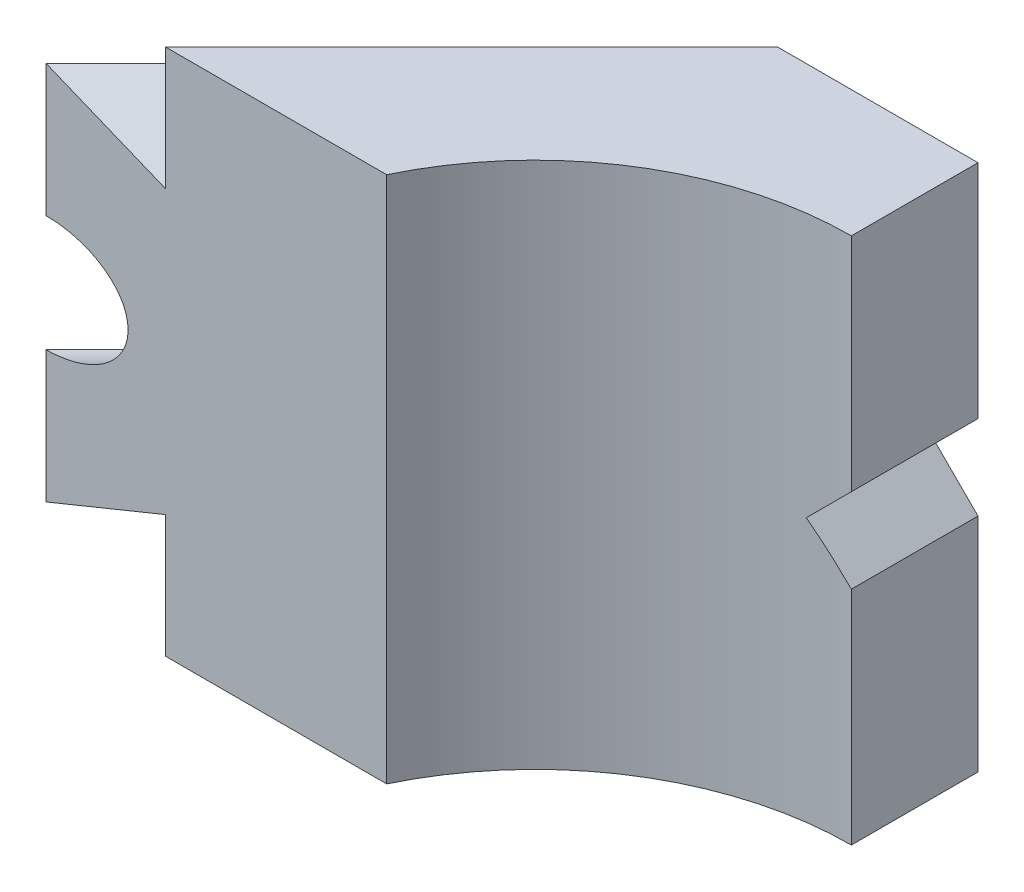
ISO-10303-21;
HEADER;
FILE_DESCRIPTION(('STEP AP214'),'2;1');
FILE_NAME('part.step','',(''),(''),'','','');
FILE_SCHEMA(('AUTOMOTIVE_DESIGN { 1 0 10303 214 1 1 1 1 }'));
ENDSEC;
DATA;
#1=APPLICATION_CONTEXT('core data for automotive mechanical design processes');
#2=APPLICATION_PROTOCOL_DEFINITION('international standard','automotive_design',2000,#1);
#3=PRODUCT_CONTEXT('',#1,'mechanical');
#4=PRODUCT('Part','Part','',(#3));
#5=PRODUCT_RELATED_PRODUCT_CATEGORY('part','',(#4));
#6=PRODUCT_DEFINITION_FORMATION('','',#4);
#7=PRODUCT_DEFINITION_CONTEXT('part definition',#1,'design');
#8=PRODUCT_DEFINITION('design','',#6,#7);
#9=PRODUCT_DEFINITION_SHAPE('','',#8);
#10=(LENGTH_UNIT() NAMED_UNIT(*) SI_UNIT(.MILLI.,.METRE.));
#11=(NAMED_UNIT(*) PLANE_ANGLE_UNIT() SI_UNIT($,.RADIAN.));
#12=(NAMED_UNIT(*) SI_UNIT($,.STERADIAN.) SOLID_ANGLE_UNIT());
#13=UNCERTAINTY_MEASURE_WITH_UNIT(LENGTH_MEASURE(1.E-05),#10,'distance_accuracy_value','');
#14=(GEOMETRIC_REPRESENTATION_CONTEXT(3) GLOBAL_UNCERTAINTY_ASSIGNED_CONTEXT((#13)) GLOBAL_UNIT_ASSIGNED_CONTEXT((#10,
#11,#12)) REPRESENTATION_CONTEXT('',''));
#15=CARTESIAN_POINT('',(0.,0.,0.));
#16=DIRECTION('',(0.,0.,1.));
#17=DIRECTION('',(1.,0.,0.));
#18=AXIS2_PLACEMENT_3D('',#15,#16,#17);
#19=CARTESIAN_POINT('',(-7.29162231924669,2.33001662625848,6.85913527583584));
#20=DIRECTION('',(0.707106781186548,0.,-0.707106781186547));
#21=DIRECTION('',(0.270856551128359,0.923728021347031,0.270856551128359));
#22=AXIS2_PLACEMENT_3D('',#19,#20,#21);
#23=PLANE('',#22);
#24=DIRECTION('',(-0.561155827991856,-0.6084474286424,-0.561155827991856));
#25=VECTOR('',#24,1.);
#26=CARTESIAN_POINT('',(-7.29162231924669,2.33001662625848,6.85913527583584));
#27=LINE('',#26,#25);
#28=CARTESIAN_POINT('',(-7.29162231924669,2.33001662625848,6.85913527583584));
#29=VERTEX_POINT('',#28);
#30=CARTESIAN_POINT('',(-8.61033851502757,0.900165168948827,5.54041908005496));
#31=VERTEX_POINT('',#30);
#32=EDGE_CURVE('E235',#29,#31,#27,.T.);
#33=ORIENTED_EDGE('',*,*,#32,.T.);
#34=DIRECTION('',(0.0920185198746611,-0.991496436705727,0.0920185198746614));
#35=VECTOR('',#34,1.);
#36=CARTESIAN_POINT('',(-8.61033851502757,0.900165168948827,5.54041908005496));
#37=LINE('',#36,#35);
#38=CARTESIAN_POINT('',(-8.39409499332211,-1.42985145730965,5.75666260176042));
#39=VERTEX_POINT('',#38);
#40=EDGE_CURVE('E238',#31,#39,#37,.T.);
#41=ORIENTED_EDGE('',*,*,#40,.T.);
#42=DIRECTION('',(0.653174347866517,-0.383049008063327,0.653174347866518));
#43=VECTOR('',#42,1.);
#44=CARTESIAN_POINT('',(-8.39409499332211,-1.42985145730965,5.75666260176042));
#45=LINE('',#44,#43);
#46=CARTESIAN_POINT('',(-6.85913527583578,-2.33001662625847,7.29162231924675));
#47=VERTEX_POINT('',#46);
#48=EDGE_CURVE('E241',#39,#47,#45,.T.);
#49=ORIENTED_EDGE('',*,*,#48,.T.);
#50=DIRECTION('',(0.561155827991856,0.6084474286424,0.561155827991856));
#51=VECTOR('',#50,1.);
#52=CARTESIAN_POINT('',(-6.85913527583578,-2.33001662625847,7.29162231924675));
#53=LINE('',#52,#51);
#54=CARTESIAN_POINT('',(-5.54041908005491,-0.900165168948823,8.61033851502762));
#55=VERTEX_POINT('',#54);
#56=EDGE_CURVE('E244',#47,#55,#53,.T.);
#57=ORIENTED_EDGE('',*,*,#56,.T.);
#58=DIRECTION('',(-0.092018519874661,0.991496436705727,-0.0920185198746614));
#59=VECTOR('',#58,1.);
#60=CARTESIAN_POINT('',(-5.54041908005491,-0.900165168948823,8.61033851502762));
#61=LINE('',#60,#59);
#62=CARTESIAN_POINT('',(-5.75666260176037,1.42985145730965,8.39409499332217));
#63=VERTEX_POINT('',#62);
#64=EDGE_CURVE('E247',#55,#63,#61,.T.);
#65=ORIENTED_EDGE('',*,*,#64,.T.);
#66=DIRECTION('',(-0.653174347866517,0.383049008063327,-0.653174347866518));
#67=VECTOR('',#66,1.);
#68=CARTESIAN_POINT('',(-5.75666260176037,1.42985145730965,8.39409499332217));
#69=LINE('',#68,#67);
#70=EDGE_CURVE('E250',#63,#29,#69,.T.);
#71=ORIENTED_EDGE('',*,*,#70,.T.);
#72=EDGE_LOOP('',(#33,#41,#49,#57,#65,#71));
#73=FACE_BOUND('',#72,.T.);
#74=ADVANCED_FACE('F14',(#73),#23,.F.);
#75=CARTESIAN_POINT('',(-8.61033851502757,0.900165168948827,5.54041908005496));
#76=DIRECTION('',(-0.701093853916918,-0.130133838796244,-0.701093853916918));
#77=DIRECTION('',(0.0920185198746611,-0.991496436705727,0.0920185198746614));
#78=AXIS2_PLACEMENT_3D('',#75,#76,#77);
#79=PLANE('',#78);
#80=DIRECTION('',(0.0920185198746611,-0.991496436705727,0.0920185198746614));
#81=VECTOR('',#80,1.);
#82=CARTESIAN_POINT('',(-11.4387656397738,0.900165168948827,8.36884620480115));
#83=LINE('',#82,#81);
#84=CARTESIAN_POINT('',(-11.4387656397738,0.900165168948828,8.36884620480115));
#85=VERTEX_POINT('',#84);
#86=CARTESIAN_POINT('',(-11.2225221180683,-1.42985145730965,8.58508972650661));
#87=VERTEX_POINT('',#86);
#88=EDGE_CURVE('E220',#85,#87,#83,.T.);
#89=ORIENTED_EDGE('',*,*,#88,.T.);
#90=DIRECTION('',(-0.707106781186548,0.,0.707106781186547));
#91=VECTOR('',#90,1.);
#92=CARTESIAN_POINT('',(-8.39409499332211,-1.42985145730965,5.75666260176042));
#93=LINE('',#92,#91);
#94=EDGE_CURVE('E263',#39,#87,#93,.T.);
#95=ORIENTED_EDGE('',*,*,#94,.F.);
#96=ORIENTED_EDGE('',*,*,#40,.F.);
#97=DIRECTION('',(-0.707106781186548,0.,0.707106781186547));
#98=VECTOR('',#97,1.);
#99=CARTESIAN_POINT('',(-8.61033851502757,0.900165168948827,5.54041908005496));
#100=LINE('',#99,#98);
#101=EDGE_CURVE('E253',#31,#85,#100,.T.);
#102=ORIENTED_EDGE('',*,*,#101,.T.);
#103=EDGE_LOOP('',(#89,#95,#96,#102));
#104=FACE_BOUND('',#103,.T.);
#105=ADVANCED_FACE('F289',(#104),#79,.F.);
#106=CARTESIAN_POINT('',(-8.39409499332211,-1.42985145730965,5.75666260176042));
#107=DIRECTION('',(-0.270856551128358,-0.923728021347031,-0.270856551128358));
#108=DIRECTION('',(0.653174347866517,-0.383049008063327,0.653174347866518));
#109=AXIS2_PLACEMENT_3D('',#106,#107,#108);
#110=PLANE('',#109);
#111=DIRECTION('',(0.653174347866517,-0.383049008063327,0.653174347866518));
#112=VECTOR('',#111,1.);
#113=CARTESIAN_POINT('',(-11.2225221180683,-1.42985145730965,8.58508972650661));
#114=LINE('',#113,#112);
#115=CARTESIAN_POINT('',(-9.68756240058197,-2.33001662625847,10.1200494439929));
#116=VERTEX_POINT('',#115);
#117=EDGE_CURVE('E223',#87,#116,#114,.T.);
#118=ORIENTED_EDGE('',*,*,#117,.T.);
#119=DIRECTION('',(-0.707106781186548,0.,0.707106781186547));
#120=VECTOR('',#119,1.);
#121=CARTESIAN_POINT('',(-6.85913527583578,-2.33001662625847,7.29162231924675));
#122=LINE('',#121,#120);
#123=EDGE_CURVE('E261',#47,#116,#122,.T.);
#124=ORIENTED_EDGE('',*,*,#123,.F.);
#125=ORIENTED_EDGE('',*,*,#48,.F.);
#126=ORIENTED_EDGE('',*,*,#94,.T.);
#127=EDGE_LOOP('',(#118,#124,#125,#126));
#128=FACE_BOUND('',#127,.T.);
#129=ADVANCED_FACE('F296',(#128),#110,.F.);
#130=CARTESIAN_POINT('',(-6.85913527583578,-2.33001662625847,7.29162231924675));
#131=DIRECTION('',(0.430237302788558,-0.793594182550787,0.430237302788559));
#132=DIRECTION('',(0.561155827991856,0.6084474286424,0.561155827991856));
#133=AXIS2_PLACEMENT_3D('',#130,#131,#132);
#134=PLANE('',#133);
#135=DIRECTION('',(0.561155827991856,0.6084474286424,0.561155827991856));
#136=VECTOR('',#135,1.);
#137=CARTESIAN_POINT('',(-9.68756240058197,-2.33001662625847,10.1200494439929));
#138=LINE('',#137,#136);
#139=CARTESIAN_POINT('',(-8.3688462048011,-0.900165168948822,11.4387656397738));
#140=VERTEX_POINT('',#139);
#141=EDGE_CURVE('E226',#116,#140,#138,.T.);
#142=ORIENTED_EDGE('',*,*,#141,.T.);
#143=DIRECTION('',(-0.707106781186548,0.,0.707106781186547));
#144=VECTOR('',#143,1.);
#145=CARTESIAN_POINT('',(-5.54041908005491,-0.900165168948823,8.61033851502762));
#146=LINE('',#145,#144);
#147=EDGE_CURVE('E259',#55,#140,#146,.T.);
#148=ORIENTED_EDGE('',*,*,#147,.F.);
#149=ORIENTED_EDGE('',*,*,#56,.F.);
#150=ORIENTED_EDGE('',*,*,#123,.T.);
#151=EDGE_LOOP('',(#142,#148,#149,#150));
#152=FACE_BOUND('',#151,.T.);
#153=ADVANCED_FACE('F308',(#152),#134,.F.);
#154=CARTESIAN_POINT('',(-5.54041908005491,-0.900165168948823,8.61033851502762));
#155=DIRECTION('',(0.701093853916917,0.130133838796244,0.701093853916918));
#156=DIRECTION('',(-0.092018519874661,0.991496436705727,-0.0920185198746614));
#157=AXIS2_PLACEMENT_3D('',#154,#155,#156);
#158=PLANE('',#157);
#159=DIRECTION('',(-0.092018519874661,0.991496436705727,-0.0920185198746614));
#160=VECTOR('',#159,1.);
#161=CARTESIAN_POINT('',(-8.3688462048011,-0.900165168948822,11.4387656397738));
#162=LINE('',#161,#160);
#163=CARTESIAN_POINT('',(-8.58508972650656,1.42985145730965,11.2225221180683));
#164=VERTEX_POINT('',#163);
#165=EDGE_CURVE('E229',#140,#164,#162,.T.);
#166=ORIENTED_EDGE('',*,*,#165,.T.);
#167=DIRECTION('',(-0.707106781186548,0.,0.707106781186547));
#168=VECTOR('',#167,1.);
#169=CARTESIAN_POINT('',(-5.75666260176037,1.42985145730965,8.39409499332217));
#170=LINE('',#169,#168);
#171=EDGE_CURVE('E257',#63,#164,#170,.T.);
#172=ORIENTED_EDGE('',*,*,#171,.F.);
#173=ORIENTED_EDGE('',*,*,#64,.F.);
#174=ORIENTED_EDGE('',*,*,#147,.T.);
#175=EDGE_LOOP('',(#166,#172,#173,#174));
#176=FACE_BOUND('',#175,.T.);
#177=ADVANCED_FACE('F304',(#176),#158,.F.);
#178=CARTESIAN_POINT('',(-5.75666260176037,1.42985145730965,8.39409499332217));
#179=DIRECTION('',(0.270856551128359,0.923728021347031,0.270856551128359));
#180=DIRECTION('',(-0.707106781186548,0.,0.707106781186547));
#181=AXIS2_PLACEMENT_3D('',#178,#179,#180);
#182=PLANE('',#181);
#183=DIRECTION('',(-0.653174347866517,0.383049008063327,-0.653174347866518));
#184=VECTOR('',#183,1.);
#185=CARTESIAN_POINT('',(-8.58508972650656,1.42985145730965,11.2225221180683));
#186=LINE('',#185,#184);
#187=CARTESIAN_POINT('',(-10.1200494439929,2.33001662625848,9.68756240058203));
#188=VERTEX_POINT('',#187);
#189=EDGE_CURVE('E232',#164,#188,#186,.T.);
#190=ORIENTED_EDGE('',*,*,#189,.T.);
#191=DIRECTION('',(-0.707106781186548,0.,0.707106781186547));
#192=VECTOR('',#191,1.);
#193=CARTESIAN_POINT('',(-7.29162231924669,2.33001662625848,6.85913527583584));
#194=LINE('',#193,#192);
#195=EDGE_CURVE('E254',#29,#188,#194,.T.);
#196=ORIENTED_EDGE('',*,*,#195,.F.);
#197=ORIENTED_EDGE('',*,*,#70,.F.);
#198=ORIENTED_EDGE('',*,*,#171,.T.);
#199=EDGE_LOOP('',(#190,#196,#197,#198));
#200=FACE_BOUND('',#199,.T.);
#201=ADVANCED_FACE('F285',(#200),#182,.F.);
#202=CARTESIAN_POINT('',(-7.29162231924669,2.33001662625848,6.85913527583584));
#203=DIRECTION('',(-0.430237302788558,0.793594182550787,-0.430237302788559));
#204=DIRECTION('',(-0.561155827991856,-0.6084474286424,-0.561155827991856));
#205=AXIS2_PLACEMENT_3D('',#202,#203,#204);
#206=PLANE('',#205);
#207=DIRECTION('',(-0.561155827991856,-0.6084474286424,-0.561155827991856));
#208=VECTOR('',#207,1.);
#209=CARTESIAN_POINT('',(-10.1200494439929,2.33001662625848,9.68756240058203));
#210=LINE('',#209,#208);
#211=EDGE_CURVE('E218',#188,#85,#210,.T.);
#212=ORIENTED_EDGE('',*,*,#211,.T.);
#213=ORIENTED_EDGE('',*,*,#101,.F.);
#214=ORIENTED_EDGE('',*,*,#32,.F.);
#215=ORIENTED_EDGE('',*,*,#195,.T.);
#216=EDGE_LOOP('',(#212,#213,#214,#215));
#217=FACE_BOUND('',#216,.T.);
#218=ADVANCED_FACE('F277',(#217),#206,.F.);
#219=CARTESIAN_POINT('',(-2.83273811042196,0.,2.83273811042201));
#220=DIRECTION('',(-0.707106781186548,0.,0.707106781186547));
#221=DIRECTION('',(-0.270856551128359,-0.923728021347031,-0.270856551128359));
#222=AXIS2_PLACEMENT_3D('',#219,#220,#221);
#223=PLANE('',#222);
#224=CARTESIAN_POINT('',(-2.83273811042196,0.,2.83273811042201));
#225=DIRECTION('',(-0.707106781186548,0.,0.707106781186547));
#226=DIRECTION('',(-0.270856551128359,-0.923728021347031,-0.270856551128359));
#227=AXIS2_PLACEMENT_3D('',#224,#225,#226);
#228=CIRCLE('',#227,5.);
#229=CARTESIAN_POINT('',(-2.83273811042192,5.,2.83273811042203));
#230=VERTEX_POINT('',#229);
#231=CARTESIAN_POINT('',(-2.83273811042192,-5.,2.83273811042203));
#232=VERTEX_POINT('',#231);
#233=EDGE_CURVE('E256',#230,#232,#228,.T.);
#234=ORIENTED_EDGE('',*,*,#233,.F.);
#235=DIRECTION('',(0.,-1.,0.));
#236=VECTOR('',#235,1.);
#237=CARTESIAN_POINT('',(-2.83273811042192,-12.5,2.83273811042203));
#238=LINE('',#237,#236);
#239=EDGE_CURVE('E205',#230,#232,#238,.T.);
#240=ORIENTED_EDGE('',*,*,#239,.T.);
#241=EDGE_LOOP('',(#234,#240));
#242=FACE_BOUND('',#241,.T.);
#243=ADVANCED_FACE('F275',(#242),#223,.F.);
#244=CARTESIAN_POINT('',(-9.90380592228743,0.,9.90380592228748));
#245=DIRECTION('',(-0.707106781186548,0.,0.707106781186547));
#246=DIRECTION('',(-0.270856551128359,-0.923728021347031,-0.270856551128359));
#247=AXIS2_PLACEMENT_3D('',#244,#245,#246);
#248=PLANE('',#247);
#249=DIRECTION('',(0.,-1.,0.));
#250=VECTOR('',#249,1.);
#251=CARTESIAN_POINT('',(-9.90380592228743,-12.5,9.90380592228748));
#252=LINE('',#251,#250);
#253=CARTESIAN_POINT('',(-9.90380592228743,-2.75,9.90380592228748));
#254=VERTEX_POINT('',#253);
#255=CARTESIAN_POINT('',(-9.90380592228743,-5.,9.90380592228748));
#256=VERTEX_POINT('',#255);
#257=EDGE_CURVE('E31',#254,#256,#252,.T.);
#258=ORIENTED_EDGE('',*,*,#257,.F.);
#259=CARTESIAN_POINT('',(-9.90380592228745,0.,9.90380592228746));
#260=DIRECTION('',(-0.707106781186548,0.,0.707106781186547));
#261=DIRECTION('',(0.707106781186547,0.,0.707106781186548));
#262=AXIS2_PLACEMENT_3D('',#259,#260,#261);
#263=CIRCLE('',#262,2.75);
#264=CARTESIAN_POINT('',(-9.90380592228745,2.75,9.90380592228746));
#265=VERTEX_POINT('',#264);
#266=EDGE_CURVE('E530',#254,#265,#263,.T.);
#267=ORIENTED_EDGE('',*,*,#266,.T.);
#268=CARTESIAN_POINT('',(-9.90380592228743,5.,9.90380592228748));
#269=VERTEX_POINT('',#268);
#270=EDGE_CURVE('E39',#269,#265,#252,.T.);
#271=ORIENTED_EDGE('',*,*,#270,.F.);
#272=CARTESIAN_POINT('',(-9.90380592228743,0.,9.90380592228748));
#273=DIRECTION('',(-0.707106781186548,0.,0.707106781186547));
#274=DIRECTION('',(-0.270856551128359,-0.923728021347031,-0.270856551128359));
#275=AXIS2_PLACEMENT_3D('',#272,#273,#274);
#276=CIRCLE('',#275,5.);
#277=EDGE_CURVE('E18',#269,#256,#276,.T.);
#278=ORIENTED_EDGE('',*,*,#277,.T.);
#279=EDGE_LOOP('',(#258,#267,#271,#278));
#280=FACE_BOUND('',#279,.T.);
#281=ORIENTED_EDGE('',*,*,#211,.F.);
#282=ORIENTED_EDGE('',*,*,#189,.F.);
#283=ORIENTED_EDGE('',*,*,#165,.F.);
#284=ORIENTED_EDGE('',*,*,#141,.F.);
#285=ORIENTED_EDGE('',*,*,#117,.F.);
#286=ORIENTED_EDGE('',*,*,#88,.F.);
#287=EDGE_LOOP('',(#281,#282,#283,#284,#285,#286));
#288=FACE_BOUND('',#287,.T.);
#289=ADVANCED_FACE('F271',(#280,#288),#248,.T.);
#290=CARTESIAN_POINT('',(-9.90380592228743,0.,9.90380592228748));
#291=DIRECTION('',(0.707106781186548,0.,-0.707106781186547));
#292=DIRECTION('',(0.270856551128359,0.923728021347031,0.270856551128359));
#293=AXIS2_PLACEMENT_3D('',#290,#291,#292);
#294=CYLINDRICAL_SURFACE('',#293,5.);
#295=DIRECTION('',(-0.707106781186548,0.,0.707106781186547));
#296=VECTOR('',#295,1.);
#297=CARTESIAN_POINT('',(-2.83273811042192,-5.,2.83273811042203));
#298=LINE('',#297,#296);
#299=EDGE_CURVE('E9',#256,#232,#298,.F.);
#300=ORIENTED_EDGE('',*,*,#299,.F.);
#301=ORIENTED_EDGE('',*,*,#277,.F.);
#302=DIRECTION('',(-0.707106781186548,0.,0.707106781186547));
#303=VECTOR('',#302,1.);
#304=CARTESIAN_POINT('',(-2.83273811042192,5.,2.83273811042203));
#305=LINE('',#304,#303);
#306=EDGE_CURVE('E23',#230,#269,#305,.T.);
#307=ORIENTED_EDGE('',*,*,#306,.F.);
#308=ORIENTED_EDGE('',*,*,#233,.T.);
#309=EDGE_LOOP('',(#300,#301,#307,#308));
#310=FACE_BOUND('',#309,.T.);
#311=ADVANCED_FACE('F16',(#310),#294,.T.);
#312=CARTESIAN_POINT('',(15.16,12.5,21.));
#313=DIRECTION('',(0.,-1.,0.));
#314=DIRECTION('',(1.,0.,0.));
#315=AXIS2_PLACEMENT_3D('',#312,#313,#314);
#316=CYLINDRICAL_SURFACE('',#315,15.);
#317=CARTESIAN_POINT('',(15.16,2.,21.));
#318=DIRECTION('',(0.707106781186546,-0.707106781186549,0.));
#319=DIRECTION('',(-0.707106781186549,-0.707106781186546,0.));
#320=AXIS2_PLACEMENT_3D('',#317,#318,#319);
#321=ELLIPSE('',#320,21.2132034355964,15.);
#322=CARTESIAN_POINT('',(15.16,2.,6.));
#323=VERTEX_POINT('',#322);
#324=CARTESIAN_POINT('',(13.16,0.,6.13393125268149));
#325=VERTEX_POINT('',#324);
#326=EDGE_CURVE('E552',#323,#325,#321,.F.);
#327=ORIENTED_EDGE('',*,*,#326,.F.);
#328=DIRECTION('',(0.,-1.,0.));
#329=VECTOR('',#328,1.);
#330=CARTESIAN_POINT('',(15.16,12.5,6.));
#331=LINE('',#330,#329);
#332=CARTESIAN_POINT('',(15.16,12.5,6.));
#333=VERTEX_POINT('',#332);
#334=EDGE_CURVE('E196',#333,#323,#331,.T.);
#335=ORIENTED_EDGE('',*,*,#334,.F.);
#336=CARTESIAN_POINT('',(15.16,12.5,21.));
#337=DIRECTION('',(0.,-1.,0.));
#338=DIRECTION('',(-1.,0.,0.));
#339=AXIS2_PLACEMENT_3D('',#336,#337,#338);
#340=CIRCLE('',#339,15.);
#341=CARTESIAN_POINT('',(1.64149416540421,12.5,14.5));
#342=VERTEX_POINT('',#341);
#343=EDGE_CURVE('E568',#342,#333,#340,.T.);
#344=ORIENTED_EDGE('',*,*,#343,.F.);
#345=DIRECTION('',(0.,-1.,0.));
#346=VECTOR('',#345,1.);
#347=CARTESIAN_POINT('',(1.64149416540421,12.5,14.5));
#348=LINE('',#347,#346);
#349=CARTESIAN_POINT('',(1.64149416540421,-12.5,14.5));
#350=VERTEX_POINT('',#349);
#351=EDGE_CURVE('E192',#342,#350,#348,.T.);
#352=ORIENTED_EDGE('',*,*,#351,.T.);
#353=CARTESIAN_POINT('',(15.16,-12.5,21.));
#354=DIRECTION('',(0.,-1.,0.));
#355=DIRECTION('',(-1.,0.,0.));
#356=AXIS2_PLACEMENT_3D('',#353,#354,#355);
#357=CIRCLE('',#356,15.);
#358=CARTESIAN_POINT('',(15.16,-12.5,6.));
#359=VERTEX_POINT('',#358);
#360=EDGE_CURVE('E557',#350,#359,#357,.T.);
#361=ORIENTED_EDGE('',*,*,#360,.T.);
#362=CARTESIAN_POINT('',(15.16,-2.,6.));
#363=VERTEX_POINT('',#362);
#364=EDGE_CURVE('E578',#363,#359,#331,.T.);
#365=ORIENTED_EDGE('',*,*,#364,.F.);
#366=CARTESIAN_POINT('',(15.16,-2.,21.));
#367=DIRECTION('',(0.707106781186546,0.707106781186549,0.));
#368=DIRECTION('',(0.707106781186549,-0.707106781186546,0.));
#369=AXIS2_PLACEMENT_3D('',#366,#367,#368);
#370=ELLIPSE('',#369,21.2132034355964,15.);
#371=EDGE_CURVE('E550',#325,#363,#370,.F.);
#372=ORIENTED_EDGE('',*,*,#371,.F.);
#373=EDGE_LOOP('',(#327,#335,#344,#352,#361,#365,#372));
#374=FACE_BOUND('',#373,.T.);
#375=ADVANCED_FACE('F388',(#374),#316,.F.);
#376=CARTESIAN_POINT('',(15.16,-12.5,21.));
#377=DIRECTION('',(0.,1.,0.));
#378=DIRECTION('',(-1.,0.,0.));
#379=AXIS2_PLACEMENT_3D('',#376,#377,#378);
#380=PLANE('',#379);
#381=DIRECTION('',(1.,0.,0.));
#382=VECTOR('',#381,1.);
#383=CARTESIAN_POINT('',(-14.5,-12.5,14.5));
#384=LINE('',#383,#382);
#385=CARTESIAN_POINT('',(-8.84314575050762,-12.5,14.5));
#386=VERTEX_POINT('',#385);
#387=EDGE_CURVE('E555',#386,#350,#384,.T.);
#388=ORIENTED_EDGE('',*,*,#387,.F.);
#389=DIRECTION('',(0.707106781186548,0.,-0.707106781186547));
#390=VECTOR('',#389,1.);
#391=CARTESIAN_POINT('',(-0.0915728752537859,-12.5,5.74842712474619));
#392=LINE('',#391,#390);
#393=CARTESIAN_POINT('',(5.65685424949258,-12.5,0.));
#394=VERTEX_POINT('',#393);
#395=EDGE_CURVE('E213',#386,#394,#392,.T.);
#396=ORIENTED_EDGE('',*,*,#395,.T.);
#397=DIRECTION('',(-1.,0.,0.));
#398=VECTOR('',#397,1.);
#399=CARTESIAN_POINT('',(-14.5,-12.5,0.));
#400=LINE('',#399,#398);
#401=CARTESIAN_POINT('',(15.16,-12.5,0.));
#402=VERTEX_POINT('',#401);
#403=EDGE_CURVE('E563',#402,#394,#400,.T.);
#404=ORIENTED_EDGE('',*,*,#403,.F.);
#405=DIRECTION('',(0.,0.,-1.));
#406=VECTOR('',#405,1.);
#407=CARTESIAN_POINT('',(15.16,-12.5,0.));
#408=LINE('',#407,#406);
#409=EDGE_CURVE('E560',#359,#402,#408,.T.);
#410=ORIENTED_EDGE('',*,*,#409,.F.);
#411=ORIENTED_EDGE('',*,*,#360,.F.);
#412=EDGE_LOOP('',(#388,#396,#404,#410,#411));
#413=FACE_BOUND('',#412,.T.);
#414=ADVANCED_FACE('F394',(#413),#380,.F.);
#415=CARTESIAN_POINT('',(15.16,12.5,0.));
#416=DIRECTION('',(-1.,0.,0.));
#417=DIRECTION('',(0.,-1.,0.));
#418=AXIS2_PLACEMENT_3D('',#415,#416,#417);
#419=PLANE('',#418);
#420=DIRECTION('',(0.,0.,-1.));
#421=VECTOR('',#420,1.);
#422=CARTESIAN_POINT('',(15.16,-2.,14.5));
#423=LINE('',#422,#421);
#424=CARTESIAN_POINT('',(15.16,-2.,0.));
#425=VERTEX_POINT('',#424);
#426=EDGE_CURVE('E543',#363,#425,#423,.T.);
#427=ORIENTED_EDGE('',*,*,#426,.F.);
#428=ORIENTED_EDGE('',*,*,#364,.T.);
#429=ORIENTED_EDGE('',*,*,#409,.T.);
#430=DIRECTION('',(0.,-1.,0.));
#431=VECTOR('',#430,1.);
#432=CARTESIAN_POINT('',(15.16,12.5,0.));
#433=LINE('',#432,#431);
#434=EDGE_CURVE('E575',#425,#402,#433,.T.);
#435=ORIENTED_EDGE('',*,*,#434,.F.);
#436=EDGE_LOOP('',(#427,#428,#429,#435));
#437=FACE_BOUND('',#436,.T.);
#438=ADVANCED_FACE('F403',(#437),#419,.F.);
#439=CARTESIAN_POINT('',(15.16,-2.,14.5));
#440=DIRECTION('',(0.707106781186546,0.707106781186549,0.));
#441=DIRECTION('',(-0.707106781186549,0.707106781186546,0.));
#442=AXIS2_PLACEMENT_3D('',#439,#440,#441);
#443=PLANE('',#442);
#444=ORIENTED_EDGE('',*,*,#371,.T.);
#445=ORIENTED_EDGE('',*,*,#426,.T.);
#446=DIRECTION('',(0.707106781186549,-0.707106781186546,0.));
#447=VECTOR('',#446,1.);
#448=CARTESIAN_POINT('',(15.16,-2.,0.));
#449=LINE('',#448,#447);
#450=CARTESIAN_POINT('',(13.16,0.,0.));
#451=VERTEX_POINT('',#450);
#452=EDGE_CURVE('E540',#451,#425,#449,.T.);
#453=ORIENTED_EDGE('',*,*,#452,.F.);
#454=DIRECTION('',(0.,0.,-1.));
#455=VECTOR('',#454,1.);
#456=CARTESIAN_POINT('',(13.16,0.,14.5));
#457=LINE('',#456,#455);
#458=EDGE_CURVE('E545',#325,#451,#457,.T.);
#459=ORIENTED_EDGE('',*,*,#458,.F.);
#460=EDGE_LOOP('',(#444,#445,#453,#459));
#461=FACE_BOUND('',#460,.T.);
#462=ADVANCED_FACE('F414',(#461),#443,.T.);
#463=CARTESIAN_POINT('',(15.16,2.,14.5));
#464=DIRECTION('',(0.707106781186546,-0.707106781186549,0.));
#465=DIRECTION('',(0.707106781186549,0.707106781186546,0.));
#466=AXIS2_PLACEMENT_3D('',#463,#464,#465);
#467=PLANE('',#466);
#468=ORIENTED_EDGE('',*,*,#326,.T.);
#469=ORIENTED_EDGE('',*,*,#458,.T.);
#470=DIRECTION('',(-0.707106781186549,-0.707106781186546,0.));
#471=VECTOR('',#470,1.);
#472=CARTESIAN_POINT('',(15.16,2.,0.));
#473=LINE('',#472,#471);
#474=CARTESIAN_POINT('',(15.16,2.,0.));
#475=VERTEX_POINT('',#474);
#476=EDGE_CURVE('E536',#475,#451,#473,.T.);
#477=ORIENTED_EDGE('',*,*,#476,.F.);
#478=DIRECTION('',(0.,0.,-1.));
#479=VECTOR('',#478,1.);
#480=CARTESIAN_POINT('',(15.16,2.,14.5));
#481=LINE('',#480,#479);
#482=EDGE_CURVE('E547',#323,#475,#481,.T.);
#483=ORIENTED_EDGE('',*,*,#482,.F.);
#484=EDGE_LOOP('',(#468,#469,#477,#483));
#485=FACE_BOUND('',#484,.T.);
#486=ADVANCED_FACE('F406',(#485),#467,.T.);
#487=ORIENTED_EDGE('',*,*,#482,.T.);
#488=CARTESIAN_POINT('',(15.16,12.5,0.));
#489=VERTEX_POINT('',#488);
#490=EDGE_CURVE('E576',#489,#475,#433,.T.);
#491=ORIENTED_EDGE('',*,*,#490,.F.);
#492=DIRECTION('',(0.,0.,-1.));
#493=VECTOR('',#492,1.);
#494=CARTESIAN_POINT('',(15.16,12.5,0.));
#495=LINE('',#494,#493);
#496=EDGE_CURVE('E570',#333,#489,#495,.T.);
#497=ORIENTED_EDGE('',*,*,#496,.F.);
#498=ORIENTED_EDGE('',*,*,#334,.T.);
#499=EDGE_LOOP('',(#487,#491,#497,#498));
#500=FACE_BOUND('',#499,.T.);
#501=ADVANCED_FACE('F396',(#500),#419,.F.);
#502=CARTESIAN_POINT('',(15.16,12.5,21.));
#503=DIRECTION('',(0.,1.,0.));
#504=DIRECTION('',(-1.,0.,0.));
#505=AXIS2_PLACEMENT_3D('',#502,#503,#504);
#506=PLANE('',#505);
#507=DIRECTION('',(0.707106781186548,0.,-0.707106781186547));
#508=VECTOR('',#507,1.);
#509=CARTESIAN_POINT('',(-0.0915728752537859,12.5,5.74842712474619));
#510=LINE('',#509,#508);
#511=CARTESIAN_POINT('',(-8.84314575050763,12.5,14.5));
#512=VERTEX_POINT('',#511);
#513=CARTESIAN_POINT('',(5.65685424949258,12.5,0.));
#514=VERTEX_POINT('',#513);
#515=EDGE_CURVE('E203',#512,#514,#510,.T.);
#516=ORIENTED_EDGE('',*,*,#515,.F.);
#517=DIRECTION('',(1.,0.,0.));
#518=VECTOR('',#517,1.);
#519=CARTESIAN_POINT('',(-14.5,12.5,14.5));
#520=LINE('',#519,#518);
#521=EDGE_CURVE('E566',#512,#342,#520,.T.);
#522=ORIENTED_EDGE('',*,*,#521,.T.);
#523=ORIENTED_EDGE('',*,*,#343,.T.);
#524=ORIENTED_EDGE('',*,*,#496,.T.);
#525=DIRECTION('',(-1.,0.,0.));
#526=VECTOR('',#525,1.);
#527=CARTESIAN_POINT('',(-14.5,12.5,0.));
#528=LINE('',#527,#526);
#529=EDGE_CURVE('E572',#489,#514,#528,.T.);
#530=ORIENTED_EDGE('',*,*,#529,.T.);
#531=EDGE_LOOP('',(#516,#522,#523,#524,#530));
#532=FACE_BOUND('',#531,.T.);
#533=ADVANCED_FACE('F407',(#532),#506,.T.);
#534=CARTESIAN_POINT('',(10.4084271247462,12.5,-4.75157287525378));
#535=DIRECTION('',(0.707106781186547,0.,0.707106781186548));
#536=DIRECTION('',(0.707106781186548,0.,-0.707106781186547));
#537=AXIS2_PLACEMENT_3D('',#534,#535,#536);
#538=PLANE('',#537);
#539=ORIENTED_EDGE('',*,*,#515,.T.);
#540=DIRECTION('',(0.,1.,0.));
#541=VECTOR('',#540,1.);
#542=CARTESIAN_POINT('',(5.65685424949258,12.5,0.));
#543=LINE('',#542,#541);
#544=CARTESIAN_POINT('',(5.65685424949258,6.69059892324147,0.));
#545=VERTEX_POINT('',#544);
#546=EDGE_CURVE('E599',#545,#514,#543,.T.);
#547=ORIENTED_EDGE('',*,*,#546,.F.);
#548=DIRECTION('',(-0.707106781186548,0.,0.707106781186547));
#549=VECTOR('',#548,1.);
#550=CARTESIAN_POINT('',(10.4084271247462,6.69059892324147,-4.75157287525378));
#551=LINE('',#550,#549);
#552=CARTESIAN_POINT('',(-8.84314575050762,6.69059892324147,14.5));
#553=VERTEX_POINT('',#552);
#554=EDGE_CURVE('E607',#545,#553,#551,.T.);
#555=ORIENTED_EDGE('',*,*,#554,.T.);
#556=DIRECTION('',(0.,-1.,0.));
#557=VECTOR('',#556,1.);
#558=CARTESIAN_POINT('',(-8.84314575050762,12.5,14.5));
#559=LINE('',#558,#557);
#560=EDGE_CURVE('E612',#512,#553,#559,.T.);
#561=ORIENTED_EDGE('',*,*,#560,.F.);
#562=EDGE_LOOP('',(#539,#547,#555,#561));
#563=FACE_BOUND('',#562,.T.);
#564=ADVANCED_FACE('F448',(#563),#538,.F.);
#565=CARTESIAN_POINT('',(10.4084271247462,-6.69059892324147,-4.75157287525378));
#566=DIRECTION('',(0.707106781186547,0.,0.707106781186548));
#567=DIRECTION('',(0.707106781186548,0.,-0.707106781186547));
#568=AXIS2_PLACEMENT_3D('',#565,#566,#567);
#569=PLANE('',#568);
#570=DIRECTION('',(-0.707106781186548,0.,0.707106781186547));
#571=VECTOR('',#570,1.);
#572=CARTESIAN_POINT('',(10.4084271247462,-6.69059892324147,-4.75157287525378));
#573=LINE('',#572,#571);
#574=CARTESIAN_POINT('',(5.65685424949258,-6.69059892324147,0.));
#575=VERTEX_POINT('',#574);
#576=CARTESIAN_POINT('',(-8.84314575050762,-6.69059892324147,14.5));
#577=VERTEX_POINT('',#576);
#578=EDGE_CURVE('E171',#575,#577,#573,.T.);
#579=ORIENTED_EDGE('',*,*,#578,.F.);
#580=DIRECTION('',(0.,1.,0.));
#581=VECTOR('',#580,1.);
#582=CARTESIAN_POINT('',(5.65685424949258,12.5,0.));
#583=LINE('',#582,#581);
#584=EDGE_CURVE('E185',#394,#575,#583,.T.);
#585=ORIENTED_EDGE('',*,*,#584,.F.);
#586=ORIENTED_EDGE('',*,*,#395,.F.);
#587=DIRECTION('',(0.,-1.,0.));
#588=VECTOR('',#587,1.);
#589=CARTESIAN_POINT('',(-8.84314575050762,12.5,14.5));
#590=LINE('',#589,#588);
#591=EDGE_CURVE('E176',#577,#386,#590,.T.);
#592=ORIENTED_EDGE('',*,*,#591,.F.);
#593=EDGE_LOOP('',(#579,#585,#586,#592));
#594=FACE_BOUND('',#593,.T.);
#595=ADVANCED_FACE('F457',(#594),#569,.F.);
#596=CARTESIAN_POINT('',(7.58,9.,-7.58));
#597=DIRECTION('',(-0.353553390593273,-0.86602540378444,-0.353553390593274));
#598=DIRECTION('',(0.,-0.377964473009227,0.925820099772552));
#599=AXIS2_PLACEMENT_3D('',#596,#597,#598);
#600=PLANE('',#599);
#601=ORIENTED_EDGE('',*,*,#554,.F.);
#602=DIRECTION('',(0.925820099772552,-0.377964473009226,0.));
#603=VECTOR('',#602,1.);
#604=CARTESIAN_POINT('',(-13.6533162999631,14.5739430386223,0.));
#605=LINE('',#604,#603);
#606=CARTESIAN_POINT('',(0.,9.,0.));
#607=VERTEX_POINT('',#606);
#608=EDGE_CURVE('E210',#607,#545,#605,.T.);
#609=ORIENTED_EDGE('',*,*,#608,.F.);
#610=DIRECTION('',(-0.707106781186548,0.,0.707106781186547));
#611=VECTOR('',#610,1.);
#612=CARTESIAN_POINT('',(7.58,9.,-7.58));
#613=LINE('',#612,#611);
#614=CARTESIAN_POINT('',(-14.5,9.,14.5));
#615=VERTEX_POINT('',#614);
#616=EDGE_CURVE('E175',#607,#615,#613,.T.);
#617=ORIENTED_EDGE('',*,*,#616,.T.);
#618=DIRECTION('',(-0.925820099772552,0.377964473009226,0.));
#619=VECTOR('',#618,1.);
#620=CARTESIAN_POINT('',(-15.7247448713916,9.5,14.5));
#621=LINE('',#620,#619);
#622=EDGE_CURVE('E537',#553,#615,#621,.T.);
#623=ORIENTED_EDGE('',*,*,#622,.F.);
#624=EDGE_LOOP('',(#601,#609,#617,#623));
#625=FACE_BOUND('',#624,.T.);
#626=ADVANCED_FACE('F460',(#625),#600,.F.);
#627=CARTESIAN_POINT('',(-14.5,12.5,14.5));
#628=DIRECTION('',(0.,0.,-1.));
#629=DIRECTION('',(-1.,0.,0.));
#630=AXIS2_PLACEMENT_3D('',#627,#628,#629);
#631=PLANE('',#630);
#632=DIRECTION('',(0.,-1.,0.));
#633=VECTOR('',#632,1.);
#634=CARTESIAN_POINT('',(-14.5,12.5,14.5));
#635=LINE('',#634,#633);
#636=CARTESIAN_POINT('',(-14.5,-2.75,14.5));
#637=VERTEX_POINT('',#636);
#638=CARTESIAN_POINT('',(-14.5,-9.,14.5));
#639=VERTEX_POINT('',#638);
#640=EDGE_CURVE('E182',#637,#639,#635,.T.);
#641=ORIENTED_EDGE('',*,*,#640,.T.);
#642=DIRECTION('',(0.92582009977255,0.377964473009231,0.));
#643=VECTOR('',#642,1.);
#644=CARTESIAN_POINT('',(-6.97656721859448,-5.92857142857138,14.5));
#645=LINE('',#644,#643);
#646=EDGE_CURVE('E165',#639,#577,#645,.T.);
#647=ORIENTED_EDGE('',*,*,#646,.T.);
#648=ORIENTED_EDGE('',*,*,#591,.T.);
#649=ORIENTED_EDGE('',*,*,#387,.T.);
#650=ORIENTED_EDGE('',*,*,#351,.F.);
#651=ORIENTED_EDGE('',*,*,#521,.F.);
#652=ORIENTED_EDGE('',*,*,#560,.T.);
#653=ORIENTED_EDGE('',*,*,#622,.T.);
#654=CARTESIAN_POINT('',(-14.5,2.75,14.5));
#655=VERTEX_POINT('',#654);
#656=EDGE_CURVE('E191',#615,#655,#635,.T.);
#657=ORIENTED_EDGE('',*,*,#656,.T.);
#658=CARTESIAN_POINT('',(-14.5,0.,14.5));
#659=DIRECTION('',(0.,0.,-1.));
#660=DIRECTION('',(1.,0.,0.));
#661=AXIS2_PLACEMENT_3D('',#658,#659,#660);
#662=ELLIPSE('',#661,3.88908729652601,2.75);
#663=EDGE_CURVE('E190',#637,#655,#662,.F.);
#664=ORIENTED_EDGE('',*,*,#663,.F.);
#665=EDGE_LOOP('',(#641,#647,#648,#649,#650,#651,#652,#653,#657,#664));
#666=FACE_BOUND('',#665,.T.);
#667=ADVANCED_FACE('F188',(#666),#631,.F.);
#668=CARTESIAN_POINT('',(7.58,-9.,-7.58));
#669=DIRECTION('',(-0.353553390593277,0.866025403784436,-0.353553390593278));
#670=DIRECTION('',(0.,-0.377964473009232,-0.92582009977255));
#671=AXIS2_PLACEMENT_3D('',#668,#669,#670);
#672=PLANE('',#671);
#673=DIRECTION('',(-0.707106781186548,0.,0.707106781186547));
#674=VECTOR('',#673,1.);
#675=CARTESIAN_POINT('',(7.58,-9.,-7.58));
#676=LINE('',#675,#674);
#677=CARTESIAN_POINT('',(0.,-9.,0.));
#678=VERTEX_POINT('',#677);
#679=EDGE_CURVE('E168',#678,#639,#676,.T.);
#680=ORIENTED_EDGE('',*,*,#679,.F.);
#681=DIRECTION('',(-0.92582009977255,-0.377964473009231,0.));
#682=VECTOR('',#681,1.);
#683=CARTESIAN_POINT('',(-4.90513864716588,-11.0025144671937,0.));
#684=LINE('',#683,#682);
#685=EDGE_CURVE('E216',#575,#678,#684,.T.);
#686=ORIENTED_EDGE('',*,*,#685,.F.);
#687=ORIENTED_EDGE('',*,*,#578,.T.);
#688=ORIENTED_EDGE('',*,*,#646,.F.);
#689=EDGE_LOOP('',(#680,#686,#687,#688));
#690=FACE_BOUND('',#689,.T.);
#691=ADVANCED_FACE('F167',(#690),#672,.F.);
#692=CARTESIAN_POINT('',(-14.5,12.5,0.));
#693=DIRECTION('',(0.,0.,1.));
#694=DIRECTION('',(1.,0.,0.));
#695=AXIS2_PLACEMENT_3D('',#692,#693,#694);
#696=PLANE('',#695);
#697=ORIENTED_EDGE('',*,*,#584,.T.);
#698=ORIENTED_EDGE('',*,*,#685,.T.);
#699=DIRECTION('',(0.,1.,0.));
#700=VECTOR('',#699,1.);
#701=CARTESIAN_POINT('',(1.35308431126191E-13,-12.5,0.));
#702=LINE('',#701,#700);
#703=EDGE_CURVE('E184',#678,#607,#702,.T.);
#704=ORIENTED_EDGE('',*,*,#703,.T.);
#705=ORIENTED_EDGE('',*,*,#608,.T.);
#706=ORIENTED_EDGE('',*,*,#546,.T.);
#707=ORIENTED_EDGE('',*,*,#529,.F.);
#708=ORIENTED_EDGE('',*,*,#490,.T.);
#709=ORIENTED_EDGE('',*,*,#476,.T.);
#710=ORIENTED_EDGE('',*,*,#452,.T.);
#711=ORIENTED_EDGE('',*,*,#434,.T.);
#712=ORIENTED_EDGE('',*,*,#403,.T.);
#713=EDGE_LOOP('',(#697,#698,#704,#705,#706,#707,#708,#709,#710,#711,#712));
#714=FACE_BOUND('',#713,.T.);
#715=ADVANCED_FACE('F417',(#714),#696,.F.);
#716=CARTESIAN_POINT('',(-14.5,-12.5,14.5));
#717=DIRECTION('',(0.707106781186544,0.,0.707106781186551));
#718=DIRECTION('',(0.707106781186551,0.,-0.707106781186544));
#719=AXIS2_PLACEMENT_3D('',#716,#717,#718);
#720=PLANE('',#719);
#721=ORIENTED_EDGE('',*,*,#703,.F.);
#722=ORIENTED_EDGE('',*,*,#679,.T.);
#723=ORIENTED_EDGE('',*,*,#640,.F.);
#724=DIRECTION('',(0.707106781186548,0.,-0.707106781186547));
#725=VECTOR('',#724,1.);
#726=CARTESIAN_POINT('',(-14.5,-2.75,14.5));
#727=LINE('',#726,#725);
#728=EDGE_CURVE('E202',#254,#637,#727,.F.);
#729=ORIENTED_EDGE('',*,*,#728,.F.);
#730=ORIENTED_EDGE('',*,*,#257,.T.);
#731=ORIENTED_EDGE('',*,*,#299,.T.);
#732=ORIENTED_EDGE('',*,*,#239,.F.);
#733=ORIENTED_EDGE('',*,*,#306,.T.);
#734=ORIENTED_EDGE('',*,*,#270,.T.);
#735=DIRECTION('',(0.707106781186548,0.,-0.707106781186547));
#736=VECTOR('',#735,1.);
#737=CARTESIAN_POINT('',(-14.5,2.75,14.5));
#738=LINE('',#737,#736);
#739=EDGE_CURVE('E194',#655,#265,#738,.T.);
#740=ORIENTED_EDGE('',*,*,#739,.F.);
#741=ORIENTED_EDGE('',*,*,#656,.F.);
#742=ORIENTED_EDGE('',*,*,#616,.F.);
#743=EDGE_LOOP('',(#721,#722,#723,#729,#730,#731,#732,#733,#734,#740,#741,#742));
#744=FACE_BOUND('',#743,.T.);
#745=ADVANCED_FACE('F180',(#744),#720,.F.);
#746=CARTESIAN_POINT('',(-14.5,0.,14.5));
#747=DIRECTION('',(0.707106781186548,0.,-0.707106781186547));
#748=DIRECTION('',(-0.707106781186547,0.,-0.707106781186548));
#749=AXIS2_PLACEMENT_3D('',#746,#747,#748);
#750=CYLINDRICAL_SURFACE('',#749,2.75);
#751=ORIENTED_EDGE('',*,*,#728,.T.);
#752=ORIENTED_EDGE('',*,*,#663,.T.);
#753=ORIENTED_EDGE('',*,*,#739,.T.);
#754=ORIENTED_EDGE('',*,*,#266,.F.);
#755=EDGE_LOOP('',(#751,#752,#753,#754));
#756=FACE_BOUND('',#755,.T.);
#757=ADVANCED_FACE('F426',(#756),#750,.F.);
#758=CLOSED_SHELL('',(#74,#105,#129,#153,#177,#201,#218,#243,#289,#311,#375,#414,#438,#462,#486,
#501,#533,#564,#595,#626,#667,#691,#715,#745,#757));
#759=MANIFOLD_SOLID_BREP('B1',#758);
#760=ADVANCED_BREP_SHAPE_REPRESENTATION('',(#18,#759),#14);
#761=SHAPE_DEFINITION_REPRESENTATION(#9,#760);
ENDSEC;
END-ISO-10303-21;
